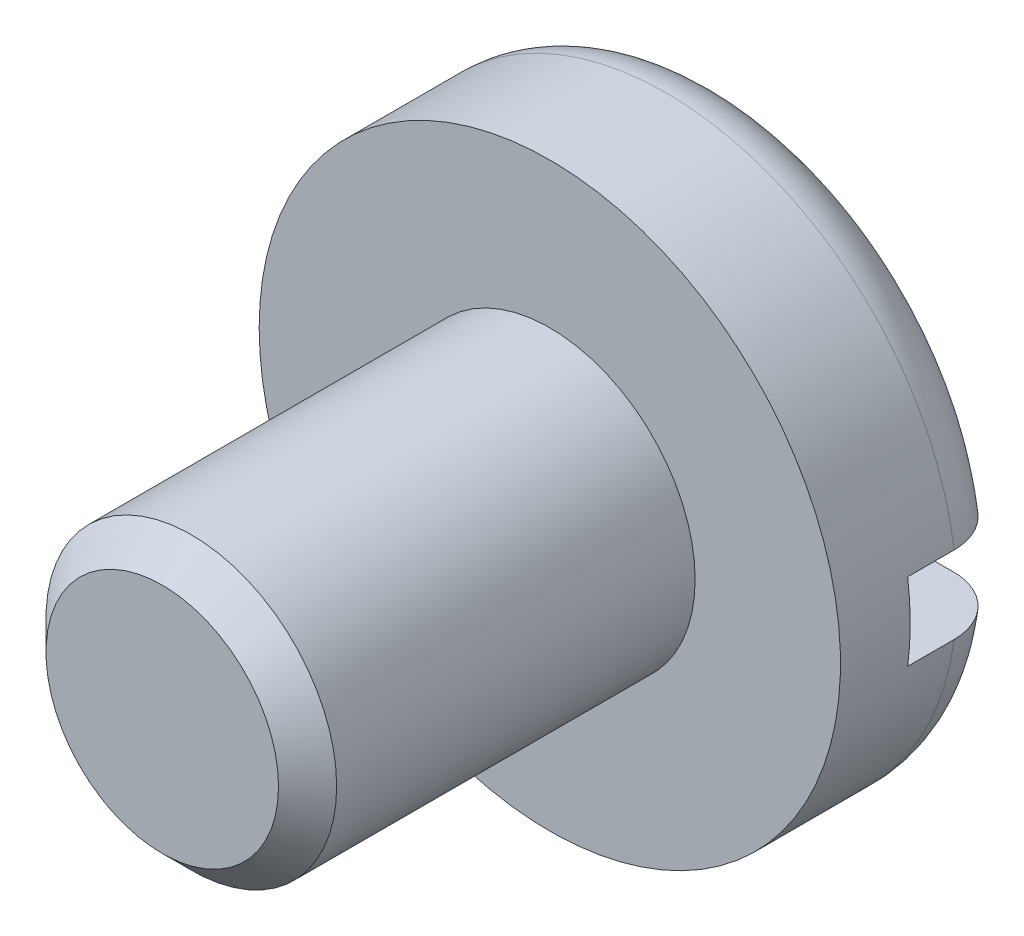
ISO-10303-21;
HEADER;
FILE_DESCRIPTION(('STEP AP214'),'2;1');
FILE_NAME('part.step','',(''),(''),'','','');
FILE_SCHEMA(('AUTOMOTIVE_DESIGN { 1 0 10303 214 1 1 1 1 }'));
ENDSEC;
DATA;
#1=APPLICATION_CONTEXT('core data for automotive mechanical design processes');
#2=APPLICATION_PROTOCOL_DEFINITION('international standard','automotive_design',2000,#1);
#3=PRODUCT_CONTEXT('',#1,'mechanical');
#4=PRODUCT('Part','Part','',(#3));
#5=PRODUCT_RELATED_PRODUCT_CATEGORY('part','',(#4));
#6=PRODUCT_DEFINITION_FORMATION('','',#4);
#7=PRODUCT_DEFINITION_CONTEXT('part definition',#1,'design');
#8=PRODUCT_DEFINITION('design','',#6,#7);
#9=PRODUCT_DEFINITION_SHAPE('','',#8);
#10=(LENGTH_UNIT() NAMED_UNIT(*) SI_UNIT(.MILLI.,.METRE.));
#11=(NAMED_UNIT(*) PLANE_ANGLE_UNIT() SI_UNIT($,.RADIAN.));
#12=(NAMED_UNIT(*) SI_UNIT($,.STERADIAN.) SOLID_ANGLE_UNIT());
#13=UNCERTAINTY_MEASURE_WITH_UNIT(LENGTH_MEASURE(1.E-05),#10,'distance_accuracy_value','');
#14=(GEOMETRIC_REPRESENTATION_CONTEXT(3) GLOBAL_UNCERTAINTY_ASSIGNED_CONTEXT((#13)) GLOBAL_UNIT_ASSIGNED_CONTEXT((#10,
#11,#12)) REPRESENTATION_CONTEXT('',''));
#15=CARTESIAN_POINT('',(0.,0.,0.));
#16=DIRECTION('',(0.,0.,1.));
#17=DIRECTION('',(1.,0.,0.));
#18=AXIS2_PLACEMENT_3D('',#15,#16,#17);
#19=CARTESIAN_POINT('',(0.,0.,-1.8));
#20=DIRECTION('',(0.,0.,1.));
#21=DIRECTION('',(1.,0.,0.));
#22=AXIS2_PLACEMENT_3D('',#19,#20,#21);
#23=PLANE('',#22);
#24=DIRECTION('',(1.,0.,0.));
#25=VECTOR('',#24,1.);
#26=CARTESIAN_POINT('',(-3.,-0.4,-1.8));
#27=LINE('',#26,#25);
#28=CARTESIAN_POINT('',(-2.36643191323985,-0.4,-1.8));
#29=VERTEX_POINT('',#28);
#30=CARTESIAN_POINT('',(2.36643191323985,-0.4,-1.8));
#31=VERTEX_POINT('',#30);
#32=EDGE_CURVE('E158',#29,#31,#27,.T.);
#33=ORIENTED_EDGE('',*,*,#32,.T.);
#34=CARTESIAN_POINT('',(0.,0.,-1.8));
#35=DIRECTION('',(0.,0.,-1.));
#36=DIRECTION('',(-1.,0.,0.));
#37=AXIS2_PLACEMENT_3D('',#34,#35,#36);
#38=CIRCLE('',#37,2.4);
#39=EDGE_CURVE('E110',#31,#29,#38,.T.);
#40=ORIENTED_EDGE('',*,*,#39,.T.);
#41=EDGE_LOOP('',(#33,#40));
#42=FACE_BOUND('',#41,.T.);
#43=ADVANCED_FACE('F29',(#42),#23,.F.);
#44=DIRECTION('',(-1.,0.,0.));
#45=VECTOR('',#44,1.);
#46=CARTESIAN_POINT('',(-3.,0.4,-1.8));
#47=LINE('',#46,#45);
#48=CARTESIAN_POINT('',(2.36643191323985,0.4,-1.8));
#49=VERTEX_POINT('',#48);
#50=CARTESIAN_POINT('',(-2.36643191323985,0.4,-1.8));
#51=VERTEX_POINT('',#50);
#52=EDGE_CURVE('E95',#49,#51,#47,.T.);
#53=ORIENTED_EDGE('',*,*,#52,.T.);
#54=EDGE_CURVE('E106',#51,#49,#38,.T.);
#55=ORIENTED_EDGE('',*,*,#54,.T.);
#56=EDGE_LOOP('',(#53,#55));
#57=FACE_BOUND('',#56,.T.);
#58=ADVANCED_FACE('F152',(#57),#23,.F.);
#59=CARTESIAN_POINT('',(0.,0.,-1.2));
#60=DIRECTION('',(0.,0.,-1.));
#61=DIRECTION('',(-1.,0.,0.));
#62=AXIS2_PLACEMENT_3D('',#59,#60,#61);
#63=TOROIDAL_SURFACE('',#62,2.4,0.6);
#64=CARTESIAN_POINT('',(-2.86791536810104,-0.4,-1.53809091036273));
#65=CARTESIAN_POINT('',(-2.88691562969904,-0.4,-1.51049908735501));
#66=CARTESIAN_POINT('',(-2.90360941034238,-0.4,-1.48129079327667));
#67=CARTESIAN_POINT('',(-2.93187395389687,-0.4,-1.42046435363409));
#68=CARTESIAN_POINT('',(-2.94343900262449,-0.4,-1.3888435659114));
#69=CARTESIAN_POINT('',(-2.9610841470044,-0.4,-1.32411273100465));
#70=CARTESIAN_POINT('',(-2.96716574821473,-0.4,-1.29100309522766));
#71=CARTESIAN_POINT('',(-2.973665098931,-0.4,-1.22424080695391));
#72=CARTESIAN_POINT('',(-2.97408418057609,-0.4,-1.19058828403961));
#73=CARTESIAN_POINT('',(-2.96925650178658,-0.4,-1.12377978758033));
#74=CARTESIAN_POINT('',(-2.96402436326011,-0.4,-1.09062275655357));
#75=CARTESIAN_POINT('',(-2.94807176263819,-0.4,-1.02565585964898));
#76=CARTESIAN_POINT('',(-2.93735113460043,-0.4,-0.993846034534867));
#77=CARTESIAN_POINT('',(-2.9107260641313,-0.4,-0.932444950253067));
#78=CARTESIAN_POINT('',(-2.89481734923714,-0.4,-0.902855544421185));
#79=CARTESIAN_POINT('',(-2.85828371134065,-0.4,-0.846748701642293));
#80=CARTESIAN_POINT('',(-2.83765870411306,-0.4,-0.820231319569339));
#81=CARTESIAN_POINT('',(-2.79216361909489,-0.4,-0.770859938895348));
#82=CARTESIAN_POINT('',(-2.76727091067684,-0.4,-0.748026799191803));
#83=CARTESIAN_POINT('',(-2.71403599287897,-0.4,-0.706818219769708));
#84=CARTESIAN_POINT('',(-2.68569364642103,-0.4,-0.68844295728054));
#85=CARTESIAN_POINT('',(-2.62608519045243,-0.4,-0.656485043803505));
#86=CARTESIAN_POINT('',(-2.59479436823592,-0.4,-0.642948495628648));
#87=CARTESIAN_POINT('',(-2.53040085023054,-0.4,-0.621255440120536));
#88=CARTESIAN_POINT('',(-2.49729804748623,-0.4,-0.613099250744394));
#89=CARTESIAN_POINT('',(-2.4298233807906,-0.4,-0.602302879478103));
#90=CARTESIAN_POINT('',(-2.39544144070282,-0.4,-0.599725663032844));
#91=CARTESIAN_POINT('',(-2.32672713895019,-0.4,-0.600320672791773));
#92=CARTESIAN_POINT('',(-2.29239478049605,-0.4,-0.603493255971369));
#93=CARTESIAN_POINT('',(-2.22440412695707,-0.4,-0.615543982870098));
#94=CARTESIAN_POINT('',(-2.19075551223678,-0.4,-0.624476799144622));
#95=CARTESIAN_POINT('',(-2.12542650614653,-0.4,-0.64784847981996));
#96=CARTESIAN_POINT('',(-2.09374619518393,-0.4,-0.662287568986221));
#97=CARTESIAN_POINT('',(-2.03317876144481,-0.4,-0.696326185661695));
#98=CARTESIAN_POINT('',(-2.00429919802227,-0.4,-0.715939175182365));
#99=CARTESIAN_POINT('',(-1.95028138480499,-0.4,-0.759778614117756));
#100=CARTESIAN_POINT('',(-1.92514302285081,-0.4,-0.784004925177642));
#101=CARTESIAN_POINT('',(-1.879604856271,-0.4,-0.836153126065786));
#102=CARTESIAN_POINT('',(-1.85916168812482,-0.4,-0.864037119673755));
#103=CARTESIAN_POINT('',(-1.82336424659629,-0.4,-0.922900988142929));
#104=CARTESIAN_POINT('',(-1.80800931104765,-0.4,-0.953880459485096));
#105=CARTESIAN_POINT('',(-1.783172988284,-0.4,-1.01736374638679));
#106=CARTESIAN_POINT('',(-1.77357543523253,-0.4,-1.04982210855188));
#107=CARTESIAN_POINT('',(-1.76008936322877,-0.4,-1.11590300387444));
#108=CARTESIAN_POINT('',(-1.75620005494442,-0.4,-1.14952537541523));
#109=CARTESIAN_POINT('',(-1.75428554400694,-0.4,-1.21627187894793));
#110=CARTESIAN_POINT('',(-1.75614646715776,-0.4,-1.24939279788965));
#111=CARTESIAN_POINT('',(-1.76542044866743,-0.4,-1.31484631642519));
#112=CARTESIAN_POINT('',(-1.77283334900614,-0.4,-1.34717893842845));
#113=CARTESIAN_POINT('',(-1.79293509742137,-0.4,-1.41006202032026));
#114=CARTESIAN_POINT('',(-1.80560987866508,-0.4,-1.4406169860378));
#115=CARTESIAN_POINT('',(-1.83582889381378,-0.4,-1.49921405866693));
#116=CARTESIAN_POINT('',(-1.85337349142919,-0.4,-1.52725597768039));
#117=CARTESIAN_POINT('',(-1.8931254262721,-0.4,-1.58053047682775));
#118=CARTESIAN_POINT('',(-1.91540419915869,-0.4,-1.6057097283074));
#119=CARTESIAN_POINT('',(-1.96379049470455,-0.4,-1.6520716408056));
#120=CARTESIAN_POINT('',(-1.98989845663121,-0.4,-1.67325384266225));
#121=CARTESIAN_POINT('',(-2.04582323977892,-0.4,-1.71150342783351));
#122=CARTESIAN_POINT('',(-2.07570903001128,-0.4,-1.72847001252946));
#123=CARTESIAN_POINT('',(-2.13787630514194,-0.4,-1.75722500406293));
#124=CARTESIAN_POINT('',(-2.17015799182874,-0.4,-1.76901297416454));
#125=CARTESIAN_POINT('',(-2.23668253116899,-0.4,-1.78721942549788));
#126=CARTESIAN_POINT('',(-2.27094628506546,-0.4,-1.79356164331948));
#127=CARTESIAN_POINT('',(-2.34005178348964,-0.4,-1.80041149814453));
#128=CARTESIAN_POINT('',(-2.37489351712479,-0.4,-1.80091924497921));
#129=CARTESIAN_POINT('',(-2.4442018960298,-0.4,-1.79606324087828));
#130=CARTESIAN_POINT('',(-2.47866813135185,-0.4,-1.79069361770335));
#131=CARTESIAN_POINT('',(-2.54620434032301,-0.4,-1.77419498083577));
#132=CARTESIAN_POINT('',(-2.57927401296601,-0.4,-1.76306473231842));
#133=CARTESIAN_POINT('',(-2.64279515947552,-0.4,-1.73544271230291));
#134=CARTESIAN_POINT('',(-2.67326439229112,-0.4,-1.71899173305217));
#135=CARTESIAN_POINT('',(-2.73093679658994,-0.4,-1.68116176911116));
#136=CARTESIAN_POINT('',(-2.75814405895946,-0.4,-1.65978905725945));
#137=CARTESIAN_POINT('',(-2.79912965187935,-0.4,-1.62148942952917));
#138=CARTESIAN_POINT('',(-2.81414187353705,-0.4,-1.60586063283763));
#139=CARTESIAN_POINT('',(-2.84239557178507,-0.4,-1.57307653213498));
#140=CARTESIAN_POINT('',(-2.85563706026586,-0.4,-1.5559212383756));
#141=CARTESIAN_POINT('',(-2.86791536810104,-0.4,-1.53809091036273));
#142=B_SPLINE_CURVE_WITH_KNOTS('',3,(#64,#65,#66,#67,#68,#69,#70,#71,#72,#73,#74,#75,#76,#77,
#78,#79,#80,#81,#82,#83,#84,#85,#86,#87,#88,#89,#90,#91,#92,#93,#94,#95,#96,#97,#98,#99,#100,
#101,#102,#103,#104,#105,#106,#107,#108,#109,#110,#111,#112,#113,#114,#115,#116,#117,#118,#119,
#120,#121,#122,#123,#124,#125,#126,#127,#128,#129,#130,#131,#132,#133,#134,#135,#136,#137,#138,
#139,#140,#141),.UNSPECIFIED.,.T.,.F.,(4,2,2,2,2,2,2,2,2,2,2,2,2,2,2,2,2,2,2,2,2,2,2,2,2,2,2,2,
2,2,2,2,2,2,2,2,2,2,4),(0.,0.100424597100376,0.200960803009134,0.301469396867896,
0.401954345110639,0.502179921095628,0.602408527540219,0.702719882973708,0.803033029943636,
0.903895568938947,1.00476211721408,1.10656558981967,1.20837507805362,1.31132774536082,
1.4142868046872,1.51823776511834,1.6221929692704,1.72642136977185,1.83064664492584,
1.933866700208,2.03707331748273,2.13812063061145,2.23915396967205,2.33819941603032,
2.43724204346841,2.53602158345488,2.63480850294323,2.73520792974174,2.8356188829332,
2.93823928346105,3.04086833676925,3.14491222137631,3.24895414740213,3.3531001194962,
3.45726842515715,3.56065632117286,3.66391316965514,3.72880977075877,3.79370593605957),.UNSPECIFIED.);
#143=CARTESIAN_POINT('',(-2.9732137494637,-0.4,-1.2));
#144=VERTEX_POINT('',#143);
#145=EDGE_CURVE('E50',#29,#144,#142,.T.);
#146=ORIENTED_EDGE('',*,*,#145,.F.);
#147=ORIENTED_EDGE('',*,*,#39,.F.);
#148=CARTESIAN_POINT('',(1.80821051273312,-0.4,-1.44415878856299));
#149=CARTESIAN_POINT('',(1.79450723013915,-0.4,-1.41412104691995));
#150=CARTESIAN_POINT('',(1.783303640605,-0.4,-1.38291945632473));
#151=CARTESIAN_POINT('',(1.7662786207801,-0.4,-1.31905688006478));
#152=CARTESIAN_POINT('',(1.76046230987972,-0.4,-1.28639453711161));
#153=CARTESIAN_POINT('',(1.75442120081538,-0.4,-1.22055541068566));
#154=CARTESIAN_POINT('',(1.75419603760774,-0.4,-1.1873786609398));
#155=CARTESIAN_POINT('',(1.75934539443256,-0.4,-1.12147069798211));
#156=CARTESIAN_POINT('',(1.76471879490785,-0.4,-1.08873939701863));
#157=CARTESIAN_POINT('',(1.78084975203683,-0.4,-1.02476479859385));
#158=CARTESIAN_POINT('',(1.79158706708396,-0.4,-0.993516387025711));
#159=CARTESIAN_POINT('',(1.81808721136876,-0.4,-0.933229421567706));
#160=CARTESIAN_POINT('',(1.83385049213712,-0.4,-0.904191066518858));
#161=CARTESIAN_POINT('',(1.87016113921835,-0.4,-0.848717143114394));
#162=CARTESIAN_POINT('',(1.89077014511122,-0.4,-0.822321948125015));
#163=CARTESIAN_POINT('',(1.93603826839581,-0.4,-0.773270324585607));
#164=CARTESIAN_POINT('',(1.96069783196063,-0.4,-0.750614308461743));
#165=CARTESIAN_POINT('',(2.0139571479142,-0.4,-0.709156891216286));
#166=CARTESIAN_POINT('',(2.04263221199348,-0.4,-0.690452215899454));
#167=CARTESIAN_POINT('',(2.10267683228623,-0.4,-0.658032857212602));
#168=CARTESIAN_POINT('',(2.13404663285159,-0.4,-0.644318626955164));
#169=CARTESIAN_POINT('',(2.19913303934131,-0.4,-0.622064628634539));
#170=CARTESIAN_POINT('',(2.23287910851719,-0.4,-0.613610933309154));
#171=CARTESIAN_POINT('',(2.30131074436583,-0.4,-0.602466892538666));
#172=CARTESIAN_POINT('',(2.33599634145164,-0.4,-0.599776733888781));
#173=CARTESIAN_POINT('',(2.40544538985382,-0.4,-0.600253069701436));
#174=CARTESIAN_POINT('',(2.44020871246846,-0.4,-0.603439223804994));
#175=CARTESIAN_POINT('',(2.50869729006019,-0.4,-0.615642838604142));
#176=CARTESIAN_POINT('',(2.54242257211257,-0.4,-0.624660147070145));
#177=CARTESIAN_POINT('',(2.60763064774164,-0.4,-0.648217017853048));
#178=CARTESIAN_POINT('',(2.63912698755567,-0.4,-0.662719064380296));
#179=CARTESIAN_POINT('',(2.69919951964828,-0.4,-0.696862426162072));
#180=CARTESIAN_POINT('',(2.72777587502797,-0.4,-0.716503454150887));
#181=CARTESIAN_POINT('',(2.78085904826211,-0.4,-0.760134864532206));
#182=CARTESIAN_POINT('',(2.80540738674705,-0.4,-0.784074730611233));
#183=CARTESIAN_POINT('',(2.85008327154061,-0.4,-0.835775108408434));
#184=CARTESIAN_POINT('',(2.8702110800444,-0.4,-0.863535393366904));
#185=CARTESIAN_POINT('',(2.90525154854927,-0.4,-0.921768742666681));
#186=CARTESIAN_POINT('',(2.92021748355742,-0.4,-0.952209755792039));
#187=CARTESIAN_POINT('',(2.94478217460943,-0.4,-1.01518535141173));
#188=CARTESIAN_POINT('',(2.95438117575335,-0.4,-1.04771983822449));
#189=CARTESIAN_POINT('',(2.9678730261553,-0.4,-1.1136969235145));
#190=CARTESIAN_POINT('',(2.97180801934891,-0.4,-1.14713090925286));
#191=CARTESIAN_POINT('',(2.97399012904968,-0.4,-1.21418363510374));
#192=CARTESIAN_POINT('',(2.97223738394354,-0.4,-1.2478023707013));
#193=CARTESIAN_POINT('',(2.96311046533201,-0.4,-1.31416285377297));
#194=CARTESIAN_POINT('',(2.95575341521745,-0.4,-1.3469069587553));
#195=CARTESIAN_POINT('',(2.93565569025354,-0.4,-1.41069837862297));
#196=CARTESIAN_POINT('',(2.92291501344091,-0.4,-1.44174569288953));
#197=CARTESIAN_POINT('',(2.89239690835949,-0.4,-1.50132550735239));
#198=CARTESIAN_POINT('',(2.87461067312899,-0.4,-1.52985349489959));
#199=CARTESIAN_POINT('',(2.83452923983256,-0.4,-1.58354220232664));
#200=CARTESIAN_POINT('',(2.81223393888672,-0.4,-1.6087028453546));
#201=CARTESIAN_POINT('',(2.76362299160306,-0.4,-1.65511787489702));
#202=CARTESIAN_POINT('',(2.73728293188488,-0.4,-1.67634668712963));
#203=CARTESIAN_POINT('',(2.68144180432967,-0.4,-1.71413135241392));
#204=CARTESIAN_POINT('',(2.65194058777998,-0.4,-1.73068698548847));
#205=CARTESIAN_POINT('',(2.59030619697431,-0.4,-1.75883285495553));
#206=CARTESIAN_POINT('',(2.55814997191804,-0.4,-1.77037260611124));
#207=CARTESIAN_POINT('',(2.4923689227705,-0.4,-1.78795653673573));
#208=CARTESIAN_POINT('',(2.45874400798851,-0.4,-1.79400037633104));
#209=CARTESIAN_POINT('',(2.39057532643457,-0.4,-1.80048954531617));
#210=CARTESIAN_POINT('',(2.35602547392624,-0.4,-1.80087097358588));
#211=CARTESIAN_POINT('',(2.2873444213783,-0.4,-1.7958819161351));
#212=CARTESIAN_POINT('',(2.25321323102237,-0.4,-1.79051129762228));
#213=CARTESIAN_POINT('',(2.18602611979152,-0.4,-1.774105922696));
#214=CARTESIAN_POINT('',(2.15298206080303,-0.4,-1.76302254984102));
#215=CARTESIAN_POINT('',(2.08921057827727,-0.4,-1.73546663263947));
#216=CARTESIAN_POINT('',(2.05848379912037,-0.4,-1.71899259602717));
#217=CARTESIAN_POINT('',(2.00021398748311,-0.4,-1.68108334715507));
#218=CARTESIAN_POINT('',(1.97267445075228,-0.4,-1.65964276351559));
#219=CARTESIAN_POINT('',(1.9216665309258,-0.4,-1.61240514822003));
#220=CARTESIAN_POINT('',(1.89819309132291,-0.4,-1.58661360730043));
#221=CARTESIAN_POINT('',(1.86353882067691,-0.4,-1.54123382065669));
#222=CARTESIAN_POINT('',(1.85095456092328,-0.4,-1.52269988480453));
#223=CARTESIAN_POINT('',(1.82793428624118,-0.4,-1.48434176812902));
#224=CARTESIAN_POINT('',(1.81749824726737,-0.4,-1.46451760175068));
#225=CARTESIAN_POINT('',(1.80821051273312,-0.4,-1.44415878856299));
#226=B_SPLINE_CURVE_WITH_KNOTS('',3,(#148,#149,#150,#151,#152,#153,#154,#155,#156,#157,#158,
#159,#160,#161,#162,#163,#164,#165,#166,#167,#168,#169,#170,#171,#172,#173,#174,#175,#176,#177,
#178,#179,#180,#181,#182,#183,#184,#185,#186,#187,#188,#189,#190,#191,#192,#193,#194,#195,#196,
#197,#198,#199,#200,#201,#202,#203,#204,#205,#206,#207,#208,#209,#210,#211,#212,#213,#214,#215,
#216,#217,#218,#219,#220,#221,#222,#223,#224,#225),.UNSPECIFIED.,.T.,.F.,(4,2,2,2,2,2,2,2,2,2,2,
2,2,2,2,2,2,2,2,2,2,2,2,2,2,2,2,2,2,2,2,2,2,2,2,2,2,2,4),(0.,0.0989673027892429,
0.198028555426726,0.297083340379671,0.396118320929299,0.494782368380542,0.593455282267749,
0.693458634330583,0.793473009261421,0.895707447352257,0.997951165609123,1.10182660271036,
1.20570540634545,1.30993237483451,1.41415662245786,1.51768050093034,1.6211985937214,
1.72357156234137,1.82593845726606,1.92721478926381,2.02848649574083,2.12900070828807,
2.22951247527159,2.32971836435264,2.42992428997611,2.53030621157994,2.63069042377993,
2.73170625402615,2.83272683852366,2.93474189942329,3.03676326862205,3.13993509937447,
3.2431093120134,3.34717641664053,3.45127235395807,3.55548140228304,3.65955991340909,
3.72663817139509,3.79371567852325),.UNSPECIFIED.);
#227=CARTESIAN_POINT('',(2.9732137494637,-0.4,-1.2));
#228=VERTEX_POINT('',#227);
#229=EDGE_CURVE('E122',#228,#31,#226,.T.);
#230=ORIENTED_EDGE('',*,*,#229,.F.);
#231=CARTESIAN_POINT('',(0.,0.,-1.2));
#232=DIRECTION('',(0.,0.,-1.));
#233=DIRECTION('',(-1.,0.,0.));
#234=AXIS2_PLACEMENT_3D('',#231,#232,#233);
#235=CIRCLE('',#234,3.);
#236=EDGE_CURVE('E117',#228,#144,#235,.T.);
#237=ORIENTED_EDGE('',*,*,#236,.T.);
#238=EDGE_LOOP('',(#146,#147,#230,#237));
#239=FACE_BOUND('',#238,.T.);
#240=ADVANCED_FACE('F130',(#239),#63,.T.);
#241=CARTESIAN_POINT('',(-2.86791536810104,0.4,-1.53809091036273));
#242=CARTESIAN_POINT('',(-2.84868400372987,0.4,-1.56601293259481));
#243=CARTESIAN_POINT('',(-2.82706189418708,0.4,-1.59232017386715));
#244=CARTESIAN_POINT('',(-2.77967761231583,0.4,-1.64094009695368));
#245=CARTESIAN_POINT('',(-2.75391006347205,0.4,-1.66324751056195));
#246=CARTESIAN_POINT('',(-2.6990251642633,0.4,-1.70321130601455));
#247=CARTESIAN_POINT('',(-2.66991093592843,0.4,-1.72087197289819));
#248=CARTESIAN_POINT('',(-2.60915830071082,0.4,-1.7510936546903));
#249=CARTESIAN_POINT('',(-2.57752051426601,0.4,-1.76365591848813));
#250=CARTESIAN_POINT('',(-2.51233990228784,0.4,-1.78344987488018));
#251=CARTESIAN_POINT('',(-2.47878374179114,0.4,-1.79063764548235));
#252=CARTESIAN_POINT('',(-2.41094258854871,0.4,-1.79934399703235));
#253=CARTESIAN_POINT('',(-2.37665752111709,0.4,-1.80086199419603));
#254=CARTESIAN_POINT('',(-2.30793726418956,0.4,-1.79819413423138));
#255=CARTESIAN_POINT('',(-2.27350447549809,0.4,-1.7939462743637));
#256=CARTESIAN_POINT('',(-2.20582843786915,0.4,-1.77976818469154));
#257=CARTESIAN_POINT('',(-2.17258525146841,0.4,-1.76983765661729));
#258=CARTESIAN_POINT('',(-2.10802002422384,0.4,-1.7444896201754));
#259=CARTESIAN_POINT('',(-2.07671123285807,0.4,-1.7290383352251));
#260=CARTESIAN_POINT('',(-2.01714433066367,0.4,-1.6930784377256));
#261=CARTESIAN_POINT('',(-1.98888623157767,0.4,-1.67256980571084));
#262=CARTESIAN_POINT('',(-1.93637236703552,0.4,-1.62714599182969));
#263=CARTESIAN_POINT('',(-1.91210023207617,0.4,-1.6022497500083));
#264=CARTESIAN_POINT('',(-1.86816721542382,0.4,-1.5486737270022));
#265=CARTESIAN_POINT('',(-1.84850591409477,0.4,-1.51999429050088));
#266=CARTESIAN_POINT('',(-1.8147314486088,0.4,-1.46018356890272));
#267=CARTESIAN_POINT('',(-1.80052886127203,0.4,-1.42910280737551));
#268=CARTESIAN_POINT('',(-1.77767972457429,0.4,-1.36496231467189));
#269=CARTESIAN_POINT('',(-1.76903232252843,0.4,-1.33190288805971));
#270=CARTESIAN_POINT('',(-1.75772456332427,0.4,-1.26553575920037));
#271=CARTESIAN_POINT('',(-1.75493497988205,0.4,-1.23225003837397));
#272=CARTESIAN_POINT('',(-1.75505258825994,0.4,-1.16569015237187));
#273=CARTESIAN_POINT('',(-1.75795932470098,0.4,-1.13241598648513));
#274=CARTESIAN_POINT('',(-1.76930492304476,0.4,-1.06720273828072));
#275=CARTESIAN_POINT('',(-1.77768298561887,0.4,-1.03525304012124));
#276=CARTESIAN_POINT('',(-1.79963421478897,0.4,-0.97319290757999));
#277=CARTESIAN_POINT('',(-1.81320758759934,0.4,-0.943082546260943));
#278=CARTESIAN_POINT('',(-1.84527443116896,0.4,-0.885231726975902));
#279=CARTESIAN_POINT('',(-1.86381370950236,0.4,-0.857516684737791));
#280=CARTESIAN_POINT('',(-1.90518919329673,0.4,-0.805506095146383));
#281=CARTESIAN_POINT('',(-1.92802585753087,0.4,-0.781210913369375));
#282=CARTESIAN_POINT('',(-1.97787851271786,0.4,-0.73617072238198));
#283=CARTESIAN_POINT('',(-2.0049744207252,0.4,-0.715514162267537));
#284=CARTESIAN_POINT('',(-2.06219809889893,0.4,-0.678945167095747));
#285=CARTESIAN_POINT('',(-2.09232617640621,0.4,-0.663033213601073));
#286=CARTESIAN_POINT('',(-2.15535638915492,0.4,-0.636120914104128));
#287=CARTESIAN_POINT('',(-2.18829916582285,0.4,-0.625215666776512));
#288=CARTESIAN_POINT('',(-2.25554284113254,0.4,-0.609051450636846));
#289=CARTESIAN_POINT('',(-2.28984380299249,0.4,-0.603792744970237));
#290=CARTESIAN_POINT('',(-2.3590569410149,0.4,-0.599065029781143));
#291=CARTESIAN_POINT('',(-2.39397158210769,0.4,-0.599631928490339));
#292=CARTESIAN_POINT('',(-2.46320550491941,0.4,-0.606649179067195));
#293=CARTESIAN_POINT('',(-2.49752479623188,0.4,-0.613099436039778));
#294=CARTESIAN_POINT('',(-2.56440715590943,0.4,-0.631681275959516));
#295=CARTESIAN_POINT('',(-2.59697808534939,0.4,-0.643784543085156));
#296=CARTESIAN_POINT('',(-2.65959335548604,0.4,-0.673344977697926));
#297=CARTESIAN_POINT('',(-2.68963782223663,0.4,-0.690801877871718));
#298=CARTESIAN_POINT('',(-2.7460058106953,0.4,-0.730378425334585));
#299=CARTESIAN_POINT('',(-2.77236533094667,0.4,-0.752446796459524));
#300=CARTESIAN_POINT('',(-2.82095331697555,0.4,-0.800740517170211));
#301=CARTESIAN_POINT('',(-2.8431820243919,0.4,-0.826965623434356));
#302=CARTESIAN_POINT('',(-2.88262005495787,0.4,-0.882515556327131));
#303=CARTESIAN_POINT('',(-2.89988204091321,0.4,-0.9118029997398));
#304=CARTESIAN_POINT('',(-2.92919534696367,0.4,-0.972877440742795));
#305=CARTESIAN_POINT('',(-2.94124713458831,0.4,-1.00466421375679));
#306=CARTESIAN_POINT('',(-2.95970040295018,0.4,-1.06954657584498));
#307=CARTESIAN_POINT('',(-2.96614872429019,0.4,-1.10262885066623));
#308=CARTESIAN_POINT('',(-2.97337569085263,0.4,-1.1694160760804));
#309=CARTESIAN_POINT('',(-2.97415305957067,0.4,-1.20312116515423));
#310=CARTESIAN_POINT('',(-2.97002108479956,0.4,-1.27005512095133));
#311=CARTESIAN_POINT('',(-2.96513219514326,0.4,-1.30328526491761));
#312=CARTESIAN_POINT('',(-2.9498475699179,0.4,-1.36842386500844));
#313=CARTESIAN_POINT('',(-2.93945864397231,0.4,-1.40033390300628));
#314=CARTESIAN_POINT('',(-2.91857987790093,0.4,-1.44989721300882));
#315=CARTESIAN_POINT('',(-2.9097136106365,0.4,-1.46825183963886));
#316=CARTESIAN_POINT('',(-2.89015758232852,0.4,-1.50396217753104));
#317=CARTESIAN_POINT('',(-2.8794678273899,0.4,-1.52131789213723));
#318=CARTESIAN_POINT('',(-2.86791536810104,0.4,-1.53809091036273));
#319=B_SPLINE_CURVE_WITH_KNOTS('',3,(#241,#242,#243,#244,#245,#246,#247,#248,#249,#250,#251,
#252,#253,#254,#255,#256,#257,#258,#259,#260,#261,#262,#263,#264,#265,#266,#267,#268,#269,#270,
#271,#272,#273,#274,#275,#276,#277,#278,#279,#280,#281,#282,#283,#284,#285,#286,#287,#288,#289,
#290,#291,#292,#293,#294,#295,#296,#297,#298,#299,#300,#301,#302,#303,#304,#305,#306,#307,#308,
#309,#310,#311,#312,#313,#314,#315,#316,#317,#318),.UNSPECIFIED.,.T.,.F.,(4,2,2,2,2,2,2,2,2,2,2,
2,2,2,2,2,2,2,2,2,2,2,2,2,2,2,2,2,2,2,2,2,2,2,2,2,2,2,4),(0.,0.101636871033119,
0.203406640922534,0.305082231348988,0.40673290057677,0.509205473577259,0.611688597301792,
0.715282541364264,0.818881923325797,0.923126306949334,1.02737109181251,1.13117643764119,
1.23497233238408,1.3369869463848,1.43898589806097,1.53870999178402,1.63842611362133,
1.73705258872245,1.83568297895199,1.93525652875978,2.03484071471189,2.13658522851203,
2.23834006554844,2.34195493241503,2.44557462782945,2.54983340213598,2.65409049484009,
2.75783087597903,2.86156607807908,2.96420396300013,3.06683584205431,3.16833561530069,
3.26982627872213,3.37046016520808,3.47111670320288,3.57141102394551,3.67158145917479,
3.73263587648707,3.79369008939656),.UNSPECIFIED.);
#320=CARTESIAN_POINT('',(-2.9732137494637,0.4,-1.2));
#321=VERTEX_POINT('',#320);
#322=EDGE_CURVE('E163',#321,#51,#319,.T.);
#323=ORIENTED_EDGE('',*,*,#322,.F.);
#324=CARTESIAN_POINT('',(2.9732137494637,0.4,-1.2));
#325=VERTEX_POINT('',#324);
#326=EDGE_CURVE('E115',#321,#325,#235,.T.);
#327=ORIENTED_EDGE('',*,*,#326,.T.);
#328=CARTESIAN_POINT('',(1.80821051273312,0.4,-1.44415878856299));
#329=CARTESIAN_POINT('',(1.82231047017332,0.4,-1.47505857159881));
#330=CARTESIAN_POINT('',(1.83907724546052,0.4,-1.50477209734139));
#331=CARTESIAN_POINT('',(1.87740165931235,0.4,-1.56096909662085));
#332=CARTESIAN_POINT('',(1.89896631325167,0.4,-1.5874477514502));
#333=CARTESIAN_POINT('',(1.94618177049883,0.4,-1.63639884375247));
#334=CARTESIAN_POINT('',(1.97182686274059,0.4,-1.65887678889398));
#335=CARTESIAN_POINT('',(2.02646954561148,0.4,-1.69927713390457));
#336=CARTESIAN_POINT('',(2.05546627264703,0.4,-1.7172007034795));
#337=CARTESIAN_POINT('',(2.11645988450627,0.4,-1.7482694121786));
#338=CARTESIAN_POINT('',(2.14849486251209,0.4,-1.76133979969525));
#339=CARTESIAN_POINT('',(2.21429462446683,0.4,-1.78197209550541));
#340=CARTESIAN_POINT('',(2.24805958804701,0.4,-1.78953343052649));
#341=CARTESIAN_POINT('',(2.31668083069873,0.4,-1.79897312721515));
#342=CARTESIAN_POINT('',(2.35154411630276,0.4,-1.8008006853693));
#343=CARTESIAN_POINT('',(2.4210815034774,0.4,-1.79855854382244));
#344=CARTESIAN_POINT('',(2.45575560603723,0.4,-1.79448887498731));
#345=CARTESIAN_POINT('',(2.52381156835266,0.4,-1.78056283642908));
#346=CARTESIAN_POINT('',(2.557197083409,0.4,-1.77072435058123));
#347=CARTESIAN_POINT('',(2.62181601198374,0.4,-1.74552630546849));
#348=CARTESIAN_POINT('',(2.65304953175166,0.4,-1.7301670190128));
#349=CARTESIAN_POINT('',(2.7121444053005,0.4,-1.69452205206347));
#350=CARTESIAN_POINT('',(2.74003609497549,0.4,-1.67428667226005));
#351=CARTESIAN_POINT('',(2.79197658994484,0.4,-1.62937109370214));
#352=CARTESIAN_POINT('',(2.81602562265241,0.4,-1.60469115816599));
#353=CARTESIAN_POINT('',(2.85931177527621,0.4,-1.55188767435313));
#354=CARTESIAN_POINT('',(2.87860010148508,0.4,-1.5238060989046));
#355=CARTESIAN_POINT('',(2.91213782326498,0.4,-1.46477974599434));
#356=CARTESIAN_POINT('',(2.92638748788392,0.4,-1.43383512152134));
#357=CARTESIAN_POINT('',(2.94931443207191,0.4,-1.37026360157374));
#358=CARTESIAN_POINT('',(2.95804100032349,0.4,-1.33765447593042));
#359=CARTESIAN_POINT('',(2.9698648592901,0.4,-1.27143133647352));
#360=CARTESIAN_POINT('',(2.97296233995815,0.4,-1.23781735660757));
#361=CARTESIAN_POINT('',(2.97343453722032,0.4,-1.17071861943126));
#362=CARTESIAN_POINT('',(2.97083788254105,0.4,-1.1372340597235));
#363=CARTESIAN_POINT('',(2.96005758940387,0.4,-1.07117725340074));
#364=CARTESIAN_POINT('',(2.95187400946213,0.4,-1.0386049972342));
#365=CARTESIAN_POINT('',(2.93016485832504,0.4,-0.975303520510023));
#366=CARTESIAN_POINT('',(2.91664082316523,0.4,-0.944573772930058));
#367=CARTESIAN_POINT('',(2.88464744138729,0.4,-0.885807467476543));
#368=CARTESIAN_POINT('',(2.86617802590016,0.4,-0.857770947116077));
#369=CARTESIAN_POINT('',(2.82473788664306,0.4,-0.80504812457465));
#370=CARTESIAN_POINT('',(2.80174756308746,0.4,-0.780377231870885));
#371=CARTESIAN_POINT('',(2.75198245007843,0.4,-0.735206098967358));
#372=CARTESIAN_POINT('',(2.7252075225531,0.4,-0.714706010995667));
#373=CARTESIAN_POINT('',(2.66839302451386,0.4,-0.678266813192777));
#374=CARTESIAN_POINT('',(2.638327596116,0.4,-0.662368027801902));
#375=CARTESIAN_POINT('',(2.57597556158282,0.4,-0.635781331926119));
#376=CARTESIAN_POINT('',(2.54368883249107,0.4,-0.625093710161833));
#377=CARTESIAN_POINT('',(2.47743101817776,0.4,-0.609107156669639));
#378=CARTESIAN_POINT('',(2.44344529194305,0.4,-0.603868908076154));
#379=CARTESIAN_POINT('',(2.37507589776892,0.4,-0.599108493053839));
#380=CARTESIAN_POINT('',(2.34069220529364,0.4,-0.599586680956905));
#381=CARTESIAN_POINT('',(2.27212156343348,0.4,-0.606261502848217));
#382=CARTESIAN_POINT('',(2.23794040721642,0.4,-0.612517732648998));
#383=CARTESIAN_POINT('',(2.17110155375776,0.4,-0.630650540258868));
#384=CARTESIAN_POINT('',(2.13844393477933,0.4,-0.642527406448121));
#385=CARTESIAN_POINT('',(2.07542270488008,0.4,-0.671647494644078));
#386=CARTESIAN_POINT('',(2.04507089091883,0.4,-0.688916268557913));
#387=CARTESIAN_POINT('',(1.987719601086,0.4,-0.728335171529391));
#388=CARTESIAN_POINT('',(1.96072010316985,0.4,-0.750485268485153));
#389=CARTESIAN_POINT('',(1.91105063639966,0.4,-0.798907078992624));
#390=CARTESIAN_POINT('',(1.88835375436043,0.4,-0.825151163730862));
#391=CARTESIAN_POINT('',(1.84779009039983,0.4,-0.881138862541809));
#392=CARTESIAN_POINT('',(1.82992258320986,0.4,-0.910881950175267));
#393=CARTESIAN_POINT('',(1.79990105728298,0.4,-0.972422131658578));
#394=CARTESIAN_POINT('',(1.78764449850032,0.4,-1.0041691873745));
#395=CARTESIAN_POINT('',(1.76876607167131,0.4,-1.06930591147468));
#396=CARTESIAN_POINT('',(1.76214482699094,0.4,-1.10269576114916));
#397=CARTESIAN_POINT('',(1.75485143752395,0.4,-1.16940159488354));
#398=CARTESIAN_POINT('',(1.7540568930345,0.4,-1.20270431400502));
#399=CARTESIAN_POINT('',(1.75812388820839,0.4,-1.2689325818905));
#400=CARTESIAN_POINT('',(1.76297799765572,0.4,-1.30185856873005));
#401=CARTESIAN_POINT('',(1.77500398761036,0.4,-1.35302191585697));
#402=CARTESIAN_POINT('',(1.78038529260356,0.4,-1.37169888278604));
#403=CARTESIAN_POINT('',(1.79295726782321,0.4,-1.40843277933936));
#404=CARTESIAN_POINT('',(1.80014789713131,0.4,-1.42648972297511));
#405=CARTESIAN_POINT('',(1.80821051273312,0.4,-1.44415878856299));
#406=B_SPLINE_CURVE_WITH_KNOTS('',3,(#328,#329,#330,#331,#332,#333,#334,#335,#336,#337,#338,
#339,#340,#341,#342,#343,#344,#345,#346,#347,#348,#349,#350,#351,#352,#353,#354,#355,#356,#357,
#358,#359,#360,#361,#362,#363,#364,#365,#366,#367,#368,#369,#370,#371,#372,#373,#374,#375,#376,
#377,#378,#379,#380,#381,#382,#383,#384,#385,#386,#387,#388,#389,#390,#391,#392,#393,#394,#395,
#396,#397,#398,#399,#400,#401,#402,#403,#404,#405),.UNSPECIFIED.,.T.,.F.,(4,2,2,2,2,2,2,2,2,2,2,
2,2,2,2,2,2,2,2,2,2,2,2,2,2,2,2,2,2,2,2,2,2,2,2,2,2,2,4),(0.,0.101821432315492,
0.203792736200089,0.305622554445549,0.407426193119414,0.510738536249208,0.61406162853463,
0.718297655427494,0.822533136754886,0.926447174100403,1.03035607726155,1.13323580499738,
1.23610944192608,1.33782295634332,1.43953103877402,1.54031817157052,1.64110190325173,
1.74138008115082,1.84165720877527,1.94190551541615,2.04215521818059,2.14284952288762,
2.24354750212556,2.34510295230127,2.44666402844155,2.54934434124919,2.65203101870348,
2.75578879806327,2.8595519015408,2.96381439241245,3.06807619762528,3.17166260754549,
3.27523345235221,3.37682752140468,3.47843282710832,3.57789745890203,3.67723140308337,
3.73545609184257,3.7936794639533),.UNSPECIFIED.);
#407=EDGE_CURVE('E164',#49,#325,#406,.T.);
#408=ORIENTED_EDGE('',*,*,#407,.F.);
#409=ORIENTED_EDGE('',*,*,#54,.F.);
#410=EDGE_LOOP('',(#323,#327,#408,#409));
#411=FACE_BOUND('',#410,.T.);
#412=ADVANCED_FACE('F145',(#411),#63,.T.);
#413=CARTESIAN_POINT('',(0.,0.,0.));
#414=DIRECTION('',(0.,0.,-1.));
#415=DIRECTION('',(-1.,0.,0.));
#416=AXIS2_PLACEMENT_3D('',#413,#414,#415);
#417=CYLINDRICAL_SURFACE('',#416,3.);
#418=CARTESIAN_POINT('',(0.,0.,0.));
#419=DIRECTION('',(0.,0.,-1.));
#420=DIRECTION('',(-1.,0.,0.));
#421=AXIS2_PLACEMENT_3D('',#418,#419,#420);
#422=CIRCLE('',#421,3.);
#423=CARTESIAN_POINT('',(-3.,0.,0.));
#424=VERTEX_POINT('',#423);
#425=EDGE_CURVE('E119',#424,#424,#422,.T.);
#426=ORIENTED_EDGE('',*,*,#425,.T.);
#427=EDGE_LOOP('',(#426));
#428=FACE_BOUND('',#427,.T.);
#429=DIRECTION('',(0.,0.,-1.));
#430=VECTOR('',#429,1.);
#431=CARTESIAN_POINT('',(-2.9732137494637,-0.4,0.));
#432=LINE('',#431,#430);
#433=CARTESIAN_POINT('',(-2.9732137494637,-0.4,-0.720000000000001));
#434=VERTEX_POINT('',#433);
#435=EDGE_CURVE('E78',#144,#434,#432,.F.);
#436=ORIENTED_EDGE('',*,*,#435,.F.);
#437=ORIENTED_EDGE('',*,*,#236,.F.);
#438=DIRECTION('',(0.,0.,-1.));
#439=VECTOR('',#438,1.);
#440=CARTESIAN_POINT('',(2.9732137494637,-0.4,0.));
#441=LINE('',#440,#439);
#442=CARTESIAN_POINT('',(2.9732137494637,-0.4,-0.720000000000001));
#443=VERTEX_POINT('',#442);
#444=EDGE_CURVE('E43',#443,#228,#441,.T.);
#445=ORIENTED_EDGE('',*,*,#444,.F.);
#446=CARTESIAN_POINT('',(0.,0.,-0.720000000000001));
#447=DIRECTION('',(0.,0.,1.));
#448=DIRECTION('',(1.,0.,0.));
#449=AXIS2_PLACEMENT_3D('',#446,#447,#448);
#450=CIRCLE('',#449,3.);
#451=CARTESIAN_POINT('',(2.9732137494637,0.4,-0.720000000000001));
#452=VERTEX_POINT('',#451);
#453=EDGE_CURVE('E93',#443,#452,#450,.T.);
#454=ORIENTED_EDGE('',*,*,#453,.T.);
#455=DIRECTION('',(0.,0.,-1.));
#456=VECTOR('',#455,1.);
#457=CARTESIAN_POINT('',(2.9732137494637,0.4,0.));
#458=LINE('',#457,#456);
#459=EDGE_CURVE('E102',#325,#452,#458,.F.);
#460=ORIENTED_EDGE('',*,*,#459,.F.);
#461=ORIENTED_EDGE('',*,*,#326,.F.);
#462=DIRECTION('',(0.,0.,-1.));
#463=VECTOR('',#462,1.);
#464=CARTESIAN_POINT('',(-2.9732137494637,0.4,0.));
#465=LINE('',#464,#463);
#466=CARTESIAN_POINT('',(-2.9732137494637,0.4,-0.720000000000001));
#467=VERTEX_POINT('',#466);
#468=EDGE_CURVE('E86',#467,#321,#465,.T.);
#469=ORIENTED_EDGE('',*,*,#468,.F.);
#470=EDGE_CURVE('E91',#467,#434,#450,.T.);
#471=ORIENTED_EDGE('',*,*,#470,.T.);
#472=EDGE_LOOP('',(#436,#437,#445,#454,#460,#461,#469,#471));
#473=FACE_BOUND('',#472,.T.);
#474=ADVANCED_FACE('F98',(#428,#473),#417,.T.);
#475=CARTESIAN_POINT('',(0.,0.,0.));
#476=DIRECTION('',(0.,0.,-1.));
#477=DIRECTION('',(-1.,0.,0.));
#478=AXIS2_PLACEMENT_3D('',#475,#476,#477);
#479=PLANE('',#478);
#480=CARTESIAN_POINT('',(0.,0.,0.));
#481=DIRECTION('',(0.,0.,1.));
#482=DIRECTION('',(1.,0.,0.));
#483=AXIS2_PLACEMENT_3D('',#480,#481,#482);
#484=CIRCLE('',#483,1.5);
#485=CARTESIAN_POINT('',(1.5,0.,0.));
#486=VERTEX_POINT('',#485);
#487=EDGE_CURVE('E160',#486,#486,#484,.T.);
#488=ORIENTED_EDGE('',*,*,#487,.F.);
#489=EDGE_LOOP('',(#488));
#490=FACE_BOUND('',#489,.T.);
#491=ORIENTED_EDGE('',*,*,#425,.F.);
#492=EDGE_LOOP('',(#491));
#493=FACE_BOUND('',#492,.T.);
#494=ADVANCED_FACE('F138',(#490,#493),#479,.F.);
#495=CARTESIAN_POINT('',(-3.,-0.4,-0.720000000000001));
#496=DIRECTION('',(0.,1.,0.));
#497=DIRECTION('',(0.,0.,1.));
#498=AXIS2_PLACEMENT_3D('',#495,#496,#497);
#499=PLANE('',#498);
#500=ORIENTED_EDGE('',*,*,#229,.T.);
#501=ORIENTED_EDGE('',*,*,#32,.F.);
#502=ORIENTED_EDGE('',*,*,#145,.T.);
#503=ORIENTED_EDGE('',*,*,#435,.T.);
#504=DIRECTION('',(1.,0.,0.));
#505=VECTOR('',#504,1.);
#506=CARTESIAN_POINT('',(-3.,-0.4,-0.720000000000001));
#507=LINE('',#506,#505);
#508=EDGE_CURVE('E81',#434,#443,#507,.T.);
#509=ORIENTED_EDGE('',*,*,#508,.T.);
#510=ORIENTED_EDGE('',*,*,#444,.T.);
#511=EDGE_LOOP('',(#500,#501,#502,#503,#509,#510));
#512=FACE_BOUND('',#511,.T.);
#513=ADVANCED_FACE('F80',(#512),#499,.T.);
#514=CARTESIAN_POINT('',(-3.,0.4,-0.720000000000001));
#515=DIRECTION('',(0.,-1.,0.));
#516=DIRECTION('',(0.,0.,-1.));
#517=AXIS2_PLACEMENT_3D('',#514,#515,#516);
#518=PLANE('',#517);
#519=ORIENTED_EDGE('',*,*,#322,.T.);
#520=ORIENTED_EDGE('',*,*,#52,.F.);
#521=ORIENTED_EDGE('',*,*,#407,.T.);
#522=ORIENTED_EDGE('',*,*,#459,.T.);
#523=DIRECTION('',(-1.,0.,0.));
#524=VECTOR('',#523,1.);
#525=CARTESIAN_POINT('',(-3.,0.4,-0.720000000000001));
#526=LINE('',#525,#524);
#527=EDGE_CURVE('E94',#452,#467,#526,.T.);
#528=ORIENTED_EDGE('',*,*,#527,.T.);
#529=ORIENTED_EDGE('',*,*,#468,.T.);
#530=EDGE_LOOP('',(#519,#520,#521,#522,#528,#529));
#531=FACE_BOUND('',#530,.T.);
#532=ADVANCED_FACE('F137',(#531),#518,.T.);
#533=CARTESIAN_POINT('',(-3.,-0.4,-0.720000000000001));
#534=DIRECTION('',(0.,0.,1.));
#535=DIRECTION('',(1.,0.,0.));
#536=AXIS2_PLACEMENT_3D('',#533,#534,#535);
#537=PLANE('',#536);
#538=ORIENTED_EDGE('',*,*,#527,.F.);
#539=ORIENTED_EDGE('',*,*,#453,.F.);
#540=ORIENTED_EDGE('',*,*,#508,.F.);
#541=ORIENTED_EDGE('',*,*,#470,.F.);
#542=EDGE_LOOP('',(#538,#539,#540,#541));
#543=FACE_BOUND('',#542,.T.);
#544=ADVANCED_FACE('F90',(#543),#537,.F.);
#545=CARTESIAN_POINT('',(0.,0.,4.));
#546=DIRECTION('',(0.,0.,1.));
#547=DIRECTION('',(1.,0.,0.));
#548=AXIS2_PLACEMENT_3D('',#545,#546,#547);
#549=PLANE('',#548);
#550=CARTESIAN_POINT('',(0.,0.,4.));
#551=DIRECTION('',(0.,0.,1.));
#552=DIRECTION('',(1.,0.,0.));
#553=AXIS2_PLACEMENT_3D('',#550,#551,#552);
#554=CIRCLE('',#553,1.2);
#555=CARTESIAN_POINT('',(1.2,0.,4.));
#556=VERTEX_POINT('',#555);
#557=EDGE_CURVE('E36',#556,#556,#554,.T.);
#558=ORIENTED_EDGE('',*,*,#557,.T.);
#559=EDGE_LOOP('',(#558));
#560=FACE_BOUND('',#559,.T.);
#561=ADVANCED_FACE('F183',(#560),#549,.T.);
#562=CARTESIAN_POINT('',(0.,0.,0.));
#563=DIRECTION('',(0.,0.,1.));
#564=DIRECTION('',(1.,0.,0.));
#565=AXIS2_PLACEMENT_3D('',#562,#563,#564);
#566=CYLINDRICAL_SURFACE('',#565,1.5);
#567=CARTESIAN_POINT('',(0.,0.,3.7));
#568=DIRECTION('',(0.,0.,1.));
#569=DIRECTION('',(1.,0.,0.));
#570=AXIS2_PLACEMENT_3D('',#567,#568,#569);
#571=CIRCLE('',#570,1.5);
#572=CARTESIAN_POINT('',(1.5,0.,3.7));
#573=VERTEX_POINT('',#572);
#574=EDGE_CURVE('E11',#573,#573,#571,.F.);
#575=ORIENTED_EDGE('',*,*,#574,.T.);
#576=EDGE_LOOP('',(#575));
#577=FACE_BOUND('',#576,.T.);
#578=ORIENTED_EDGE('',*,*,#487,.T.);
#579=EDGE_LOOP('',(#578));
#580=FACE_BOUND('',#579,.T.);
#581=ADVANCED_FACE('F178',(#577,#580),#566,.T.);
#582=CARTESIAN_POINT('',(0.,0.,4.));
#583=DIRECTION('',(0.,0.,-1.));
#584=DIRECTION('',(-1.,0.,0.));
#585=AXIS2_PLACEMENT_3D('',#582,#583,#584);
#586=CONICAL_SURFACE('',#585,1.2,0.785398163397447);
#587=ORIENTED_EDGE('',*,*,#574,.F.);
#588=EDGE_LOOP('',(#587));
#589=FACE_BOUND('',#588,.T.);
#590=ORIENTED_EDGE('',*,*,#557,.F.);
#591=EDGE_LOOP('',(#590));
#592=FACE_BOUND('',#591,.T.);
#593=ADVANCED_FACE('F182',(#589,#592),#586,.T.);
#594=CLOSED_SHELL('',(#43,#58,#240,#412,#474,#494,#513,#532,#544,#561,#581,#593));
#595=MANIFOLD_SOLID_BREP('B2',#594);
#596=ADVANCED_BREP_SHAPE_REPRESENTATION('',(#18,#595),#14);
#597=SHAPE_DEFINITION_REPRESENTATION(#9,#596);
ENDSEC;
END-ISO-10303-21;
